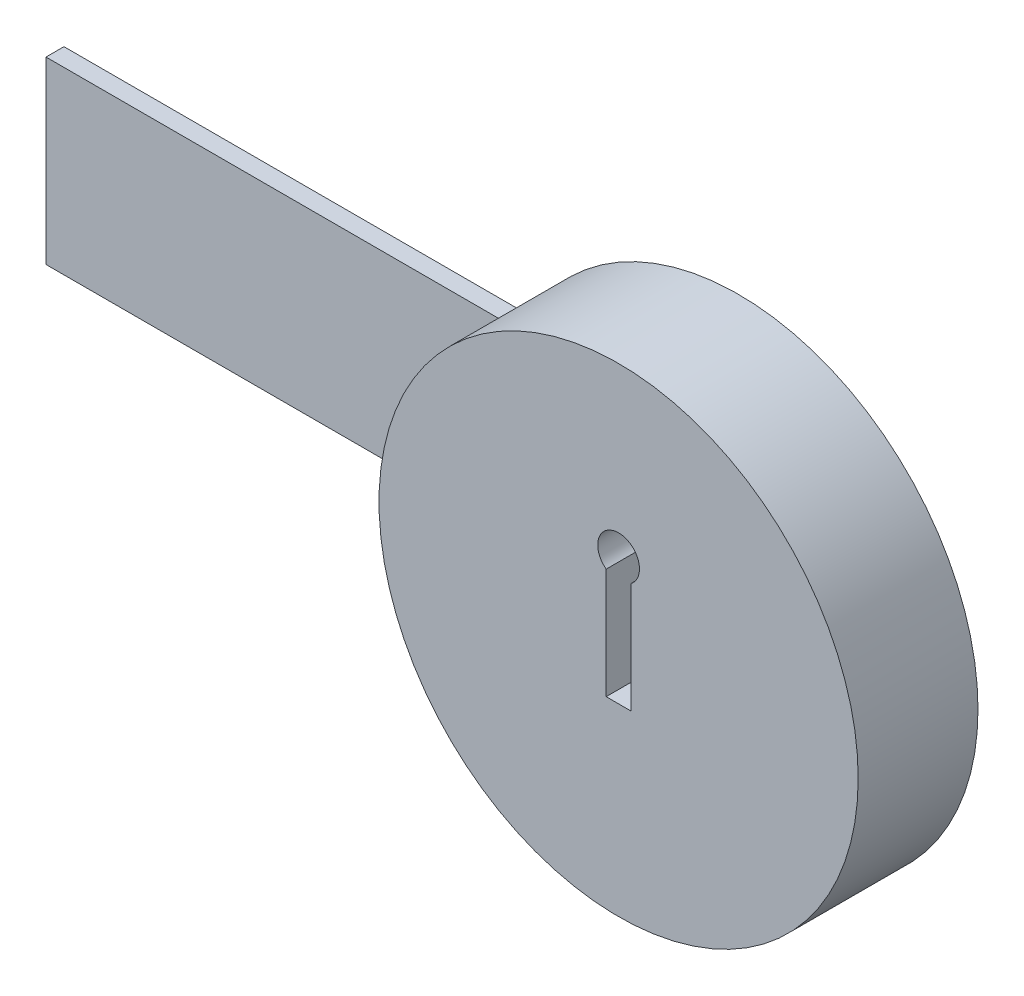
from build123d import *

# Parameters (mm, degrees)
SKETCH1_R           = 20
BOSS_EXTRUDE1_DEPTH = 10
CUT_EXTRUDE1_DEPTH  = 5
SKETCH3_W           = 1.5
SKETCH3_H           = 15
BOSS_EXTRUDE2_DEPTH = 3
SKETCH4_W           = 1.5
SKETCH4_H           = 15
BOSS_EXTRUDE3_DEPTH = 50


with BuildPart() as part:
    # Sketch1 → Boss-Extrude1 (new body)
    with BuildSketch(Plane.XY):
        Circle(SKETCH1_R)
    extrude(amount=BOSS_EXTRUDE1_DEPTH)

    # Sketch2 → Cut-Extrude1 (cut)
    with BuildSketch(Plane.XY.offset(10)):
        with BuildLine():
            Line((1.038555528, -4.611186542), (-1.038555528, -4.611186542))
            Line((-1.038555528, -4.611186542), (-1.038555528, 4.611186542))
            ThreePointArc((-1.038555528, 4.611186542), (0, 7.75253656), (1.038555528, 4.611186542))
            Line((1.038555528, 4.611186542), (1.038555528, -4.611186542))
        make_face()
    extrude(amount=-CUT_EXTRUDE1_DEPTH, mode=Mode.SUBTRACT)

    # Sketch3 → Boss-Extrude2 (add)
    with BuildSketch(Plane(origin=(0, 0, 0), x_dir=(-1, 0, 0), z_dir=(0, 0, -1))):
        with Locations((10.048721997, -0.750131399)):
            Rectangle(SKETCH3_W, SKETCH3_H)
    extrude(amount=BOSS_EXTRUDE2_DEPTH)

    # Sketch4 → Boss-Extrude3 (add)
    with BuildSketch(Plane(origin=(-9.298721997, 0, 0), x_dir=(0, 0, -1), z_dir=(1, 0, 0))):
        with Locations((2.25, -0.750131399)):
            Rectangle(SKETCH4_W, SKETCH4_H)
    extrude(amount=-BOSS_EXTRUDE3_DEPTH)


solid = part.part
